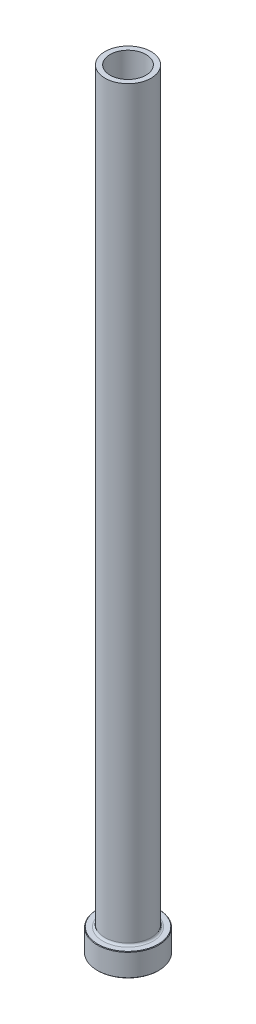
from build123d import *

# Parameters (mm, degrees)
FILLET1_R     = 0.8
CHAMFER1_SIZE = 0.2
CHAMFER3_SIZE = 0.5


with BuildPart() as part:
    # Sketch1 → Revolve1 (revolve)
    with BuildSketch(Plane.XY, mode=Mode.PRIVATE) as revolve1_sk:
        Polygon((-7, 300), (-9, 300), (-9, 9), (-12, 9), (-12, 0), (-7.25, 0), (-7.25, 233), (-7, 245), align=None)
    revolve(revolve1_sk.sketch.rotate(Axis((0, 92.187680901, 0), (0, -1, 0)), 270), axis=Axis((0, 92.187680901, 0), (0, -1, 0)))

    # Fillet1
    fillet1_edges = [part.edges().sort_by_distance(p)[0] for p in [
        (0, 9, -9),
    ]]
    fillet(fillet1_edges, radius=FILLET1_R)

    # Chamfer1
    chamfer1_edges = [part.edges().sort_by_distance(p)[0] for p in [
        (0, 0, -12),
        (0, 9, -12),
    ]]
    chamfer(chamfer1_edges, length=CHAMFER1_SIZE)

    # Chamfer3
    chamfer3_edges = [part.edges().sort_by_distance(p)[0] for p in [
        (0, 0, -7.25),
    ]]
    chamfer(chamfer3_edges, length=CHAMFER3_SIZE)


solid = part.part
